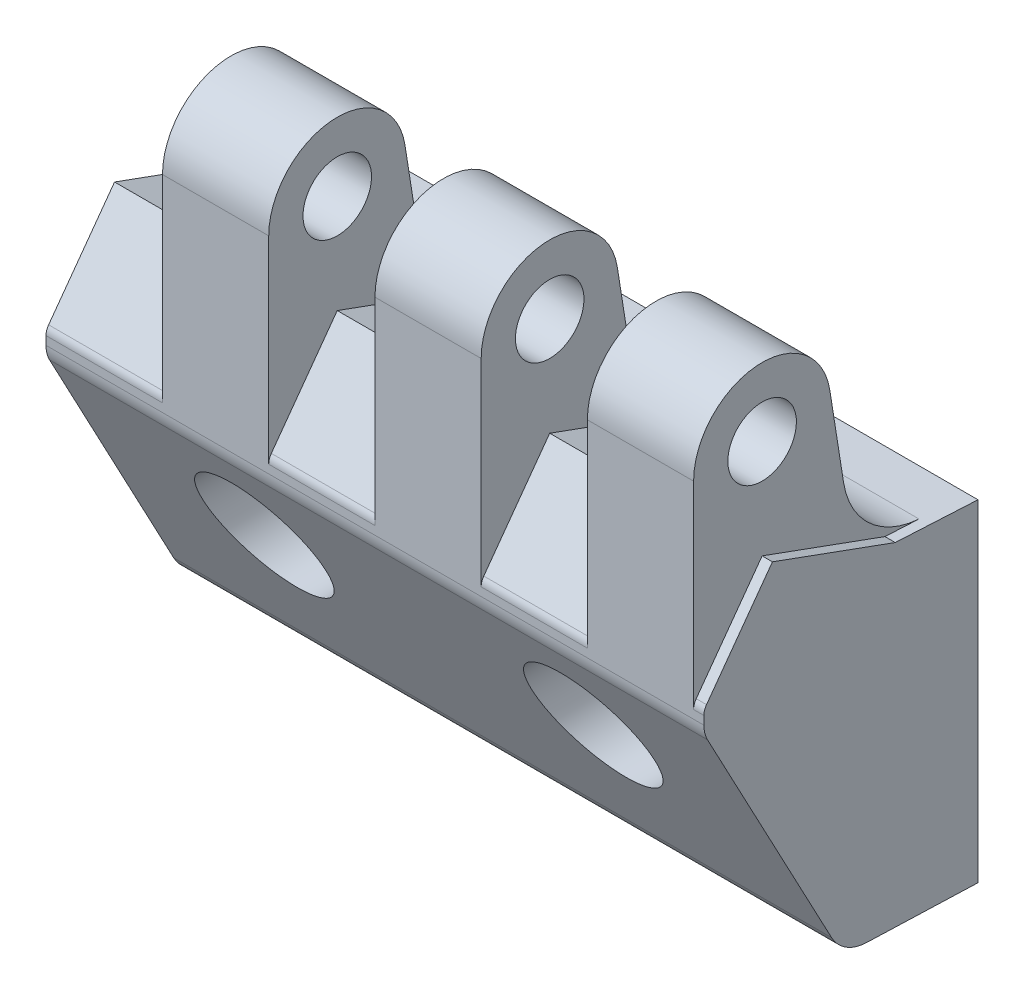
ISO-10303-21;
HEADER;
FILE_DESCRIPTION(('STEP AP214'),'2;1');
FILE_NAME('part.step','',(''),(''),'','','');
FILE_SCHEMA(('AUTOMOTIVE_DESIGN { 1 0 10303 214 1 1 1 1 }'));
ENDSEC;
DATA;
#1=APPLICATION_CONTEXT('core data for automotive mechanical design processes');
#2=APPLICATION_PROTOCOL_DEFINITION('international standard','automotive_design',2000,#1);
#3=PRODUCT_CONTEXT('',#1,'mechanical');
#4=PRODUCT('Part','Part','',(#3));
#5=PRODUCT_RELATED_PRODUCT_CATEGORY('part','',(#4));
#6=PRODUCT_DEFINITION_FORMATION('','',#4);
#7=PRODUCT_DEFINITION_CONTEXT('part definition',#1,'design');
#8=PRODUCT_DEFINITION('design','',#6,#7);
#9=PRODUCT_DEFINITION_SHAPE('','',#8);
#10=(LENGTH_UNIT() NAMED_UNIT(*) SI_UNIT(.MILLI.,.METRE.));
#11=(NAMED_UNIT(*) PLANE_ANGLE_UNIT() SI_UNIT($,.RADIAN.));
#12=(NAMED_UNIT(*) SI_UNIT($,.STERADIAN.) SOLID_ANGLE_UNIT());
#13=UNCERTAINTY_MEASURE_WITH_UNIT(LENGTH_MEASURE(1.E-05),#10,'distance_accuracy_value','');
#14=(GEOMETRIC_REPRESENTATION_CONTEXT(3) GLOBAL_UNCERTAINTY_ASSIGNED_CONTEXT((#13)) GLOBAL_UNIT_ASSIGNED_CONTEXT((#10,
#11,#12)) REPRESENTATION_CONTEXT('',''));
#15=CARTESIAN_POINT('',(0.,0.,0.));
#16=DIRECTION('',(0.,0.,1.));
#17=DIRECTION('',(1.,0.,0.));
#18=AXIS2_PLACEMENT_3D('',#15,#16,#17);
#19=CARTESIAN_POINT('',(-12.25,12.2,0.));
#20=DIRECTION('',(0.,0.99862953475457,-0.0523359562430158));
#21=DIRECTION('',(0.,0.0523359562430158,0.99862953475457));
#22=AXIS2_PLACEMENT_3D('',#19,#20,#21);
#23=PLANE('',#22);
#24=DIRECTION('',(1.,0.,0.));
#25=VECTOR('',#24,1.);
#26=CARTESIAN_POINT('',(-12.25,12.2,0.));
#27=LINE('',#26,#25);
#28=CARTESIAN_POINT('',(-12.,12.2,0.));
#29=VERTEX_POINT('',#28);
#30=CARTESIAN_POINT('',(36.,12.2,0.));
#31=VERTEX_POINT('',#30);
#32=EDGE_CURVE('E259',#29,#31,#27,.T.);
#33=ORIENTED_EDGE('',*,*,#32,.F.);
#34=DIRECTION('',(0.,-0.0523359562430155,-0.99862953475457));
#35=VECTOR('',#34,1.);
#36=CARTESIAN_POINT('',(-12.,12.516495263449,6.0390893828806));
#37=LINE('',#36,#35);
#38=CARTESIAN_POINT('',(-12.,12.516495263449,6.0390893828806));
#39=VERTEX_POINT('',#38);
#40=EDGE_CURVE('E241',#39,#29,#37,.T.);
#41=ORIENTED_EDGE('',*,*,#40,.F.);
#42=DIRECTION('',(1.,0.,0.));
#43=VECTOR('',#42,1.);
#44=CARTESIAN_POINT('',(-12.25,12.516495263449,6.0390893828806));
#45=LINE('',#44,#43);
#46=CARTESIAN_POINT('',(-3.5,12.516495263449,6.0390893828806));
#47=VERTEX_POINT('',#46);
#48=EDGE_CURVE('E263',#39,#47,#45,.T.);
#49=ORIENTED_EDGE('',*,*,#48,.T.);
#50=DIRECTION('',(0.,0.0523359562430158,0.99862953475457));
#51=VECTOR('',#50,1.);
#52=CARTESIAN_POINT('',(-3.5,12.2,0.));
#53=LINE('',#52,#51);
#54=CARTESIAN_POINT('',(-3.5,12.386207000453,3.55304122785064));
#55=VERTEX_POINT('',#54);
#56=EDGE_CURVE('E407',#55,#47,#53,.T.);
#57=ORIENTED_EDGE('',*,*,#56,.F.);
#58=DIRECTION('',(1.,0.,0.));
#59=VECTOR('',#58,1.);
#60=CARTESIAN_POINT('',(-3.5,12.386207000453,3.55304122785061));
#61=LINE('',#60,#59);
#62=CARTESIAN_POINT('',(4.25,12.386207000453,3.55304122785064));
#63=VERTEX_POINT('',#62);
#64=EDGE_CURVE('E261',#63,#55,#61,.F.);
#65=ORIENTED_EDGE('',*,*,#64,.F.);
#66=DIRECTION('',(0.,0.0523359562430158,0.99862953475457));
#67=VECTOR('',#66,1.);
#68=CARTESIAN_POINT('',(4.25,12.2,0.));
#69=LINE('',#68,#67);
#70=CARTESIAN_POINT('',(4.25,12.516495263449,6.0390893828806));
#71=VERTEX_POINT('',#70);
#72=EDGE_CURVE('E395',#63,#71,#69,.T.);
#73=ORIENTED_EDGE('',*,*,#72,.T.);
#74=CARTESIAN_POINT('',(12.,12.516495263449,6.0390893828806));
#75=VERTEX_POINT('',#74);
#76=EDGE_CURVE('E309',#71,#75,#45,.T.);
#77=ORIENTED_EDGE('',*,*,#76,.T.);
#78=DIRECTION('',(0.,0.0523359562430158,0.99862953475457));
#79=VECTOR('',#78,1.);
#80=CARTESIAN_POINT('',(12.,12.2,0.));
#81=LINE('',#80,#79);
#82=CARTESIAN_POINT('',(12.,12.386207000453,3.55304122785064));
#83=VERTEX_POINT('',#82);
#84=EDGE_CURVE('E456',#83,#75,#81,.T.);
#85=ORIENTED_EDGE('',*,*,#84,.F.);
#86=DIRECTION('',(-1.,0.,0.));
#87=VECTOR('',#86,1.);
#88=CARTESIAN_POINT('',(19.75,12.386207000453,3.55304122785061));
#89=LINE('',#88,#87);
#90=CARTESIAN_POINT('',(19.75,12.386207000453,3.55304122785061));
#91=VERTEX_POINT('',#90);
#92=EDGE_CURVE('E258',#83,#91,#89,.F.);
#93=ORIENTED_EDGE('',*,*,#92,.T.);
#94=DIRECTION('',(0.,0.0523359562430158,0.99862953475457));
#95=VECTOR('',#94,1.);
#96=CARTESIAN_POINT('',(19.75,12.2,0.));
#97=LINE('',#96,#95);
#98=CARTESIAN_POINT('',(19.75,12.516495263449,6.0390893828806));
#99=VERTEX_POINT('',#98);
#100=EDGE_CURVE('E322',#91,#99,#97,.T.);
#101=ORIENTED_EDGE('',*,*,#100,.T.);
#102=CARTESIAN_POINT('',(27.5,12.516495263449,6.0390893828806));
#103=VERTEX_POINT('',#102);
#104=EDGE_CURVE('E310',#99,#103,#45,.T.);
#105=ORIENTED_EDGE('',*,*,#104,.T.);
#106=DIRECTION('',(0.,0.0523359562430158,0.99862953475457));
#107=VECTOR('',#106,1.);
#108=CARTESIAN_POINT('',(27.5,12.2,0.));
#109=LINE('',#108,#107);
#110=CARTESIAN_POINT('',(27.5,12.386207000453,3.55304122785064));
#111=VERTEX_POINT('',#110);
#112=EDGE_CURVE('E319',#111,#103,#109,.T.);
#113=ORIENTED_EDGE('',*,*,#112,.F.);
#114=DIRECTION('',(-1.,0.,0.));
#115=VECTOR('',#114,1.);
#116=CARTESIAN_POINT('',(35.25,12.386207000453,3.55304122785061));
#117=LINE('',#116,#115);
#118=CARTESIAN_POINT('',(35.25,12.386207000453,3.55304122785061));
#119=VERTEX_POINT('',#118);
#120=EDGE_CURVE('E268',#111,#119,#117,.F.);
#121=ORIENTED_EDGE('',*,*,#120,.T.);
#122=DIRECTION('',(0.,0.0523359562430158,0.99862953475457));
#123=VECTOR('',#122,1.);
#124=CARTESIAN_POINT('',(35.25,12.2,0.));
#125=LINE('',#124,#123);
#126=CARTESIAN_POINT('',(35.25,12.516495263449,6.0390893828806));
#127=VERTEX_POINT('',#126);
#128=EDGE_CURVE('E345',#119,#127,#125,.T.);
#129=ORIENTED_EDGE('',*,*,#128,.T.);
#130=CARTESIAN_POINT('',(36.,12.516495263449,6.0390893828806));
#131=VERTEX_POINT('',#130);
#132=EDGE_CURVE('E306',#127,#131,#45,.T.);
#133=ORIENTED_EDGE('',*,*,#132,.T.);
#134=DIRECTION('',(0.,0.0523359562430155,0.99862953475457));
#135=VECTOR('',#134,1.);
#136=CARTESIAN_POINT('',(36.,12.2,0.));
#137=LINE('',#136,#135);
#138=EDGE_CURVE('E474',#31,#131,#137,.T.);
#139=ORIENTED_EDGE('',*,*,#138,.F.);
#140=EDGE_LOOP('',(#33,#41,#49,#57,#65,#73,#77,#85,#93,#101,#105,#113,#121,#129,#133,#139));
#141=FACE_BOUND('',#140,.T.);
#142=ADVANCED_FACE('F14',(#141),#23,.T.);
#143=CARTESIAN_POINT('',(-12.25,-11.715773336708,8.1391867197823));
#144=DIRECTION('',(0.,-0.999390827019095,0.0348994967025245));
#145=DIRECTION('',(0.,-0.0348994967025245,-0.999390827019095));
#146=AXIS2_PLACEMENT_3D('',#143,#144,#145);
#147=PLANE('',#146);
#148=DIRECTION('',(1.,0.,0.));
#149=VECTOR('',#148,1.);
#150=CARTESIAN_POINT('',(-12.25,-11.715773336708,8.1391867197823));
#151=LINE('',#150,#149);
#152=CARTESIAN_POINT('',(-12.,-11.715773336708,8.1391867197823));
#153=VERTEX_POINT('',#152);
#154=CARTESIAN_POINT('',(36.,-11.715773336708,8.1391867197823));
#155=VERTEX_POINT('',#154);
#156=EDGE_CURVE('E251',#153,#155,#151,.T.);
#157=ORIENTED_EDGE('',*,*,#156,.F.);
#158=DIRECTION('',(0.,0.034899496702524,0.999390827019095));
#159=VECTOR('',#158,1.);
#160=CARTESIAN_POINT('',(-12.,-12.,0.));
#161=LINE('',#160,#159);
#162=CARTESIAN_POINT('',(-12.,-12.,0.));
#163=VERTEX_POINT('',#162);
#164=EDGE_CURVE('E238',#163,#153,#161,.T.);
#165=ORIENTED_EDGE('',*,*,#164,.F.);
#166=DIRECTION('',(1.,0.,0.));
#167=VECTOR('',#166,1.);
#168=CARTESIAN_POINT('',(-12.25,-12.,0.));
#169=LINE('',#168,#167);
#170=CARTESIAN_POINT('',(36.,-12.,0.));
#171=VERTEX_POINT('',#170);
#172=EDGE_CURVE('E249',#163,#171,#169,.T.);
#173=ORIENTED_EDGE('',*,*,#172,.T.);
#174=DIRECTION('',(0.,-0.034899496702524,-0.999390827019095));
#175=VECTOR('',#174,1.);
#176=CARTESIAN_POINT('',(36.,-11.715773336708,8.1391867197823));
#177=LINE('',#176,#175);
#178=EDGE_CURVE('E471',#155,#171,#177,.T.);
#179=ORIENTED_EDGE('',*,*,#178,.F.);
#180=EDGE_LOOP('',(#157,#165,#173,#179));
#181=FACE_BOUND('',#180,.T.);
#182=ADVANCED_FACE('F16',(#181),#147,.T.);
#183=CARTESIAN_POINT('',(-12.25,-12.,0.));
#184=DIRECTION('',(0.,0.,-1.));
#185=DIRECTION('',(-1.,0.,0.));
#186=AXIS2_PLACEMENT_3D('',#183,#184,#185);
#187=PLANE('',#186);
#188=CARTESIAN_POINT('',(0.,0.,0.));
#189=DIRECTION('',(0.,0.,1.));
#190=DIRECTION('',(0.,-1.,0.));
#191=AXIS2_PLACEMENT_3D('',#188,#189,#190);
#192=CIRCLE('',#191,2.75);
#193=CARTESIAN_POINT('',(0.,-2.75,0.));
#194=VERTEX_POINT('',#193);
#195=EDGE_CURVE('E491',#194,#194,#192,.T.);
#196=ORIENTED_EDGE('',*,*,#195,.T.);
#197=EDGE_LOOP('',(#196));
#198=FACE_BOUND('',#197,.T.);
#199=CARTESIAN_POINT('',(24.,0.,0.));
#200=DIRECTION('',(0.,0.,1.));
#201=DIRECTION('',(0.,-1.,0.));
#202=AXIS2_PLACEMENT_3D('',#199,#200,#201);
#203=CIRCLE('',#202,2.75);
#204=CARTESIAN_POINT('',(24.,-2.75,0.));
#205=VERTEX_POINT('',#204);
#206=EDGE_CURVE('E500',#205,#205,#203,.T.);
#207=ORIENTED_EDGE('',*,*,#206,.T.);
#208=EDGE_LOOP('',(#207));
#209=FACE_BOUND('',#208,.T.);
#210=ORIENTED_EDGE('',*,*,#172,.F.);
#211=DIRECTION('',(0.,-1.,0.));
#212=VECTOR('',#211,1.);
#213=CARTESIAN_POINT('',(-12.,12.2,0.));
#214=LINE('',#213,#212);
#215=EDGE_CURVE('E235',#29,#163,#214,.T.);
#216=ORIENTED_EDGE('',*,*,#215,.F.);
#217=ORIENTED_EDGE('',*,*,#32,.T.);
#218=DIRECTION('',(0.,1.,0.));
#219=VECTOR('',#218,1.);
#220=CARTESIAN_POINT('',(36.,-12.,0.));
#221=LINE('',#220,#219);
#222=EDGE_CURVE('E257',#171,#31,#221,.T.);
#223=ORIENTED_EDGE('',*,*,#222,.F.);
#224=EDGE_LOOP('',(#210,#216,#217,#223));
#225=FACE_BOUND('',#224,.T.);
#226=ADVANCED_FACE('F255',(#198,#209,#225),#187,.T.);
#227=CARTESIAN_POINT('',(-12.25,8.571170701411,20.));
#228=DIRECTION('',(0.,0.,1.));
#229=DIRECTION('',(1.,0.,0.));
#230=AXIS2_PLACEMENT_3D('',#227,#228,#229);
#231=PLANE('',#230);
#232=DIRECTION('',(1.,0.,0.));
#233=VECTOR('',#232,1.);
#234=CARTESIAN_POINT('',(-12.25,8.571170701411,20.));
#235=LINE('',#234,#233);
#236=CARTESIAN_POINT('',(-12.,8.571170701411,20.));
#237=VERTEX_POINT('',#236);
#238=CARTESIAN_POINT('',(-3.5,8.571170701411,20.));
#239=VERTEX_POINT('',#238);
#240=EDGE_CURVE('E295',#237,#239,#235,.T.);
#241=ORIENTED_EDGE('',*,*,#240,.F.);
#242=DIRECTION('',(0.,1.,0.));
#243=VECTOR('',#242,1.);
#244=CARTESIAN_POINT('',(-12.,7.95707840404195,20.));
#245=LINE('',#244,#243);
#246=CARTESIAN_POINT('',(-12.,7.95707840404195,20.));
#247=VERTEX_POINT('',#246);
#248=EDGE_CURVE('E29',#247,#237,#245,.T.);
#249=ORIENTED_EDGE('',*,*,#248,.F.);
#250=DIRECTION('',(1.,0.,0.));
#251=VECTOR('',#250,1.);
#252=CARTESIAN_POINT('',(-12.25,7.957078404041,20.));
#253=LINE('',#252,#251);
#254=CARTESIAN_POINT('',(36.,7.957078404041,20.));
#255=VERTEX_POINT('',#254);
#256=EDGE_CURVE('E288',#247,#255,#253,.T.);
#257=ORIENTED_EDGE('',*,*,#256,.T.);
#258=DIRECTION('',(0.,-1.,0.));
#259=VECTOR('',#258,1.);
#260=CARTESIAN_POINT('',(36.,8.571170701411,20.));
#261=LINE('',#260,#259);
#262=CARTESIAN_POINT('',(36.,8.571170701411,20.));
#263=VERTEX_POINT('',#262);
#264=EDGE_CURVE('E485',#263,#255,#261,.T.);
#265=ORIENTED_EDGE('',*,*,#264,.F.);
#266=CARTESIAN_POINT('',(35.25,8.571170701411,20.));
#267=VERTEX_POINT('',#266);
#268=EDGE_CURVE('E290',#267,#263,#235,.T.);
#269=ORIENTED_EDGE('',*,*,#268,.F.);
#270=DIRECTION('',(0.,-1.,0.));
#271=VECTOR('',#270,1.);
#272=CARTESIAN_POINT('',(35.25,23.,20.));
#273=LINE('',#272,#271);
#274=CARTESIAN_POINT('',(35.25,23.,20.));
#275=VERTEX_POINT('',#274);
#276=EDGE_CURVE('E525',#275,#267,#273,.T.);
#277=ORIENTED_EDGE('',*,*,#276,.F.);
#278=DIRECTION('',(-1.,0.,0.));
#279=VECTOR('',#278,1.);
#280=CARTESIAN_POINT('',(35.25,23.,20.));
#281=LINE('',#280,#279);
#282=CARTESIAN_POINT('',(27.5,23.,20.));
#283=VERTEX_POINT('',#282);
#284=EDGE_CURVE('E537',#275,#283,#281,.T.);
#285=ORIENTED_EDGE('',*,*,#284,.T.);
#286=DIRECTION('',(0.,-1.,0.));
#287=VECTOR('',#286,1.);
#288=CARTESIAN_POINT('',(27.5,23.,20.));
#289=LINE('',#288,#287);
#290=CARTESIAN_POINT('',(27.5,8.571170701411,20.));
#291=VERTEX_POINT('',#290);
#292=EDGE_CURVE('E509',#283,#291,#289,.T.);
#293=ORIENTED_EDGE('',*,*,#292,.T.);
#294=CARTESIAN_POINT('',(19.75,8.571170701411,20.));
#295=VERTEX_POINT('',#294);
#296=EDGE_CURVE('E299',#295,#291,#235,.T.);
#297=ORIENTED_EDGE('',*,*,#296,.F.);
#298=DIRECTION('',(0.,-1.,0.));
#299=VECTOR('',#298,1.);
#300=CARTESIAN_POINT('',(19.75,23.,20.));
#301=LINE('',#300,#299);
#302=CARTESIAN_POINT('',(19.75,23.,20.));
#303=VERTEX_POINT('',#302);
#304=EDGE_CURVE('E426',#303,#295,#301,.T.);
#305=ORIENTED_EDGE('',*,*,#304,.F.);
#306=DIRECTION('',(-1.,0.,0.));
#307=VECTOR('',#306,1.);
#308=CARTESIAN_POINT('',(19.75,23.,20.));
#309=LINE('',#308,#307);
#310=CARTESIAN_POINT('',(12.,23.,20.));
#311=VERTEX_POINT('',#310);
#312=EDGE_CURVE('E438',#303,#311,#309,.T.);
#313=ORIENTED_EDGE('',*,*,#312,.T.);
#314=DIRECTION('',(0.,-1.,0.));
#315=VECTOR('',#314,1.);
#316=CARTESIAN_POINT('',(12.,23.,20.));
#317=LINE('',#316,#315);
#318=CARTESIAN_POINT('',(12.,8.571170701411,20.));
#319=VERTEX_POINT('',#318);
#320=EDGE_CURVE('E409',#311,#319,#317,.T.);
#321=ORIENTED_EDGE('',*,*,#320,.T.);
#322=CARTESIAN_POINT('',(4.25,8.571170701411,20.));
#323=VERTEX_POINT('',#322);
#324=EDGE_CURVE('E298',#323,#319,#235,.T.);
#325=ORIENTED_EDGE('',*,*,#324,.F.);
#326=DIRECTION('',(0.,-1.,0.));
#327=VECTOR('',#326,1.);
#328=CARTESIAN_POINT('',(4.25,23.,20.));
#329=LINE('',#328,#327);
#330=CARTESIAN_POINT('',(4.25,23.,20.));
#331=VERTEX_POINT('',#330);
#332=EDGE_CURVE('E347',#331,#323,#329,.T.);
#333=ORIENTED_EDGE('',*,*,#332,.F.);
#334=DIRECTION('',(1.,0.,0.));
#335=VECTOR('',#334,1.);
#336=CARTESIAN_POINT('',(-3.5,23.,20.));
#337=LINE('',#336,#335);
#338=CARTESIAN_POINT('',(-3.5,23.,20.));
#339=VERTEX_POINT('',#338);
#340=EDGE_CURVE('E379',#339,#331,#337,.T.);
#341=ORIENTED_EDGE('',*,*,#340,.F.);
#342=DIRECTION('',(0.,-1.,0.));
#343=VECTOR('',#342,1.);
#344=CARTESIAN_POINT('',(-3.5,23.,20.));
#345=LINE('',#344,#343);
#346=EDGE_CURVE('E365',#339,#239,#345,.T.);
#347=ORIENTED_EDGE('',*,*,#346,.T.);
#348=EDGE_LOOP('',(#241,#249,#257,#265,#269,#277,#285,#293,#297,#305,#313,#321,#325,#333,#341,#347));
#349=FACE_BOUND('',#348,.T.);
#350=ADVANCED_FACE('F584',(#349),#231,.T.);
#351=CARTESIAN_POINT('',(-12.25,7.95707840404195,17.7499999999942));
#352=DIRECTION('',(1.,0.,0.));
#353=DIRECTION('',(0.,1.,0.));
#354=AXIS2_PLACEMENT_3D('',#351,#352,#353);
#355=CYLINDRICAL_SURFACE('',#354,2.25000000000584);
#356=ORIENTED_EDGE('',*,*,#256,.F.);
#357=CARTESIAN_POINT('',(-12.,7.95707840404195,17.7499999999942));
#358=DIRECTION('',(-1.,0.,0.));
#359=DIRECTION('',(0.,0.,1.));
#360=AXIS2_PLACEMENT_3D('',#357,#358,#359);
#361=CIRCLE('',#360,2.25000000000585);
#362=CARTESIAN_POINT('',(-12.,6.900767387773,19.736632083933));
#363=VERTEX_POINT('',#362);
#364=EDGE_CURVE('E655',#363,#247,#361,.T.);
#365=ORIENTED_EDGE('',*,*,#364,.F.);
#366=DIRECTION('',(1.,0.,0.));
#367=VECTOR('',#366,1.);
#368=CARTESIAN_POINT('',(-12.25,6.900767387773,19.736632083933));
#369=LINE('',#368,#367);
#370=CARTESIAN_POINT('',(36.,6.900767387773,19.736632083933));
#371=VERTEX_POINT('',#370);
#372=EDGE_CURVE('E281',#363,#371,#369,.T.);
#373=ORIENTED_EDGE('',*,*,#372,.T.);
#374=CARTESIAN_POINT('',(36.,7.95707840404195,17.7499999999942));
#375=DIRECTION('',(1.,0.,0.));
#376=DIRECTION('',(0.,0.,-1.));
#377=AXIS2_PLACEMENT_3D('',#374,#375,#376);
#378=CIRCLE('',#377,2.25000000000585);
#379=EDGE_CURVE('E488',#255,#371,#378,.T.);
#380=ORIENTED_EDGE('',*,*,#379,.F.);
#381=EDGE_LOOP('',(#356,#365,#373,#380));
#382=FACE_BOUND('',#381,.T.);
#383=ADVANCED_FACE('F277',(#382),#355,.T.);
#384=CARTESIAN_POINT('',(-12.25,6.900767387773,19.736632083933));
#385=DIRECTION('',(0.,-0.469471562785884,0.882947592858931));
#386=DIRECTION('',(0.,-0.882947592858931,-0.469471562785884));
#387=AXIS2_PLACEMENT_3D('',#384,#385,#386);
#388=PLANE('',#387);
#389=CARTESIAN_POINT('',(0.,0.,16.0674289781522));
#390=DIRECTION('',(0.,-0.469471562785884,0.882947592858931));
#391=DIRECTION('',(0.,0.882947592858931,0.469471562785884));
#392=AXIS2_PLACEMENT_3D('',#389,#390,#391);
#393=ELLIPSE('',#392,5.09656522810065,4.5);
#394=CARTESIAN_POINT('',(0.,4.5,18.4601214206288));
#395=VERTEX_POINT('',#394);
#396=EDGE_CURVE('E9',#395,#395,#393,.T.);
#397=ORIENTED_EDGE('',*,*,#396,.F.);
#398=EDGE_LOOP('',(#397));
#399=FACE_BOUND('',#398,.T.);
#400=CARTESIAN_POINT('',(24.,0.,16.0674289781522));
#401=DIRECTION('',(0.,-0.469471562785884,0.882947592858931));
#402=DIRECTION('',(0.,0.882947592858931,0.469471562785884));
#403=AXIS2_PLACEMENT_3D('',#400,#401,#402);
#404=ELLIPSE('',#403,5.09656522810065,4.5);
#405=CARTESIAN_POINT('',(24.,4.5,18.4601214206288));
#406=VERTEX_POINT('',#405);
#407=EDGE_CURVE('E22',#406,#406,#404,.T.);
#408=ORIENTED_EDGE('',*,*,#407,.F.);
#409=EDGE_LOOP('',(#408));
#410=FACE_BOUND('',#409,.T.);
#411=ORIENTED_EDGE('',*,*,#372,.F.);
#412=DIRECTION('',(0.,0.882947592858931,0.469471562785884));
#413=VECTOR('',#412,1.);
#414=CARTESIAN_POINT('',(-12.,-10.126015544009,10.683331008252));
#415=LINE('',#414,#413);
#416=CARTESIAN_POINT('',(-12.,-10.126015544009,10.683331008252));
#417=VERTEX_POINT('',#416);
#418=EDGE_CURVE('E282',#417,#363,#415,.T.);
#419=ORIENTED_EDGE('',*,*,#418,.F.);
#420=DIRECTION('',(1.,0.,0.));
#421=VECTOR('',#420,1.);
#422=CARTESIAN_POINT('',(-12.25,-10.126015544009,10.683331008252));
#423=LINE('',#422,#421);
#424=CARTESIAN_POINT('',(36.,-10.126015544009,10.683331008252));
#425=VERTEX_POINT('',#424);
#426=EDGE_CURVE('E37',#417,#425,#423,.T.);
#427=ORIENTED_EDGE('',*,*,#426,.T.);
#428=DIRECTION('',(0.,-0.882947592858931,-0.469471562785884));
#429=VECTOR('',#428,1.);
#430=CARTESIAN_POINT('',(36.,6.900767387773,19.736632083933));
#431=LINE('',#430,#429);
#432=EDGE_CURVE('E283',#371,#425,#431,.T.);
#433=ORIENTED_EDGE('',*,*,#432,.F.);
#434=EDGE_LOOP('',(#411,#419,#427,#433));
#435=FACE_BOUND('',#434,.T.);
#436=ADVANCED_FACE('F274',(#399,#410,#435),#388,.T.);
#437=CARTESIAN_POINT('',(-12.25,-8.7176008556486,8.03448822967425));
#438=DIRECTION('',(1.,0.,0.));
#439=DIRECTION('',(0.,1.,0.));
#440=AXIS2_PLACEMENT_3D('',#437,#438,#439);
#441=CYLINDRICAL_SURFACE('',#440,3.00000000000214);
#442=ORIENTED_EDGE('',*,*,#426,.F.);
#443=CARTESIAN_POINT('',(-12.,-8.7176008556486,8.03448822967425));
#444=DIRECTION('',(-1.,0.,0.));
#445=DIRECTION('',(0.,0.,1.));
#446=AXIS2_PLACEMENT_3D('',#443,#444,#445);
#447=CIRCLE('',#446,3.00000000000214);
#448=EDGE_CURVE('E252',#153,#417,#447,.T.);
#449=ORIENTED_EDGE('',*,*,#448,.F.);
#450=ORIENTED_EDGE('',*,*,#156,.T.);
#451=CARTESIAN_POINT('',(36.,-8.7176008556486,8.03448822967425));
#452=DIRECTION('',(1.,0.,0.));
#453=DIRECTION('',(0.,0.,-1.));
#454=AXIS2_PLACEMENT_3D('',#451,#452,#453);
#455=CIRCLE('',#454,3.00000000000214);
#456=EDGE_CURVE('E468',#425,#155,#455,.T.);
#457=ORIENTED_EDGE('',*,*,#456,.F.);
#458=EDGE_LOOP('',(#442,#449,#450,#457));
#459=FACE_BOUND('',#458,.T.);
#460=ADVANCED_FACE('F276',(#459),#441,.T.);
#461=CARTESIAN_POINT('',(-12.25,12.516495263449,6.0390893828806));
#462=DIRECTION('',(0.,0.939692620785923,-0.342020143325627));
#463=DIRECTION('',(0.,0.342020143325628,0.939692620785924));
#464=AXIS2_PLACEMENT_3D('',#461,#462,#463);
#465=PLANE('',#464);
#466=ORIENTED_EDGE('',*,*,#48,.F.);
#467=DIRECTION('',(0.,-0.342020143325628,-0.939692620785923));
#468=VECTOR('',#467,1.);
#469=CARTESIAN_POINT('',(-12.,15.778,15.));
#470=LINE('',#469,#468);
#471=CARTESIAN_POINT('',(-12.,15.778,15.));
#472=VERTEX_POINT('',#471);
#473=EDGE_CURVE('E1478',#472,#39,#470,.T.);
#474=ORIENTED_EDGE('',*,*,#473,.F.);
#475=DIRECTION('',(1.,0.,0.));
#476=VECTOR('',#475,1.);
#477=CARTESIAN_POINT('',(-12.25,15.778,15.));
#478=LINE('',#477,#476);
#479=CARTESIAN_POINT('',(-3.5,15.778,15.));
#480=VERTEX_POINT('',#479);
#481=EDGE_CURVE('E305',#472,#480,#478,.T.);
#482=ORIENTED_EDGE('',*,*,#481,.T.);
#483=DIRECTION('',(0.,0.342020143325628,0.939692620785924));
#484=VECTOR('',#483,1.);
#485=CARTESIAN_POINT('',(-3.5,12.516495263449,6.0390893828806));
#486=LINE('',#485,#484);
#487=EDGE_CURVE('E404',#47,#480,#486,.T.);
#488=ORIENTED_EDGE('',*,*,#487,.F.);
#489=EDGE_LOOP('',(#466,#474,#482,#488));
#490=FACE_BOUND('',#489,.T.);
#491=ADVANCED_FACE('F690',(#490),#465,.T.);
#492=CARTESIAN_POINT('',(-12.25,15.778,15.));
#493=DIRECTION('',(0.,0.587785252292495,0.809016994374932));
#494=DIRECTION('',(0.,-0.809016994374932,0.587785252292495));
#495=AXIS2_PLACEMENT_3D('',#492,#493,#494);
#496=PLANE('',#495);
#497=ORIENTED_EDGE('',*,*,#481,.F.);
#498=DIRECTION('',(0.,0.809016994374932,-0.587785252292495));
#499=VECTOR('',#498,1.);
#500=CARTESIAN_POINT('',(-12.,9.158955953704,19.809016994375));
#501=LINE('',#500,#499);
#502=CARTESIAN_POINT('',(-12.,9.158955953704,19.809016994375));
#503=VERTEX_POINT('',#502);
#504=EDGE_CURVE('E1475',#503,#472,#501,.T.);
#505=ORIENTED_EDGE('',*,*,#504,.F.);
#506=DIRECTION('',(1.,0.,0.));
#507=VECTOR('',#506,1.);
#508=CARTESIAN_POINT('',(-12.25,9.158955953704,19.809016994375));
#509=LINE('',#508,#507);
#510=CARTESIAN_POINT('',(-3.5,9.158955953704,19.809016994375));
#511=VERTEX_POINT('',#510);
#512=EDGE_CURVE('E300',#503,#511,#509,.T.);
#513=ORIENTED_EDGE('',*,*,#512,.T.);
#514=DIRECTION('',(0.,-0.809016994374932,0.587785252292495));
#515=VECTOR('',#514,1.);
#516=CARTESIAN_POINT('',(-3.5,15.778,15.));
#517=LINE('',#516,#515);
#518=EDGE_CURVE('E401',#480,#511,#517,.T.);
#519=ORIENTED_EDGE('',*,*,#518,.F.);
#520=EDGE_LOOP('',(#497,#505,#513,#519));
#521=FACE_BOUND('',#520,.T.);
#522=ADVANCED_FACE('F847',(#521),#496,.T.);
#523=CARTESIAN_POINT('',(-12.25,8.5711707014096,18.9999999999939));
#524=DIRECTION('',(1.,0.,0.));
#525=DIRECTION('',(0.,1.,0.));
#526=AXIS2_PLACEMENT_3D('',#523,#524,#525);
#527=CYLINDRICAL_SURFACE('',#526,1.00000000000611);
#528=ORIENTED_EDGE('',*,*,#512,.F.);
#529=CARTESIAN_POINT('',(-12.,8.5711707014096,18.9999999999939));
#530=DIRECTION('',(-1.,0.,0.));
#531=DIRECTION('',(0.,0.,1.));
#532=AXIS2_PLACEMENT_3D('',#529,#530,#531);
#533=CIRCLE('',#532,1.0000000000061);
#534=EDGE_CURVE('E653',#237,#503,#533,.T.);
#535=ORIENTED_EDGE('',*,*,#534,.F.);
#536=ORIENTED_EDGE('',*,*,#240,.T.);
#537=CARTESIAN_POINT('',(-3.5,8.5711707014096,18.9999999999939));
#538=DIRECTION('',(-1.,0.,0.));
#539=DIRECTION('',(0.,-1.,0.));
#540=AXIS2_PLACEMENT_3D('',#537,#538,#539);
#541=CIRCLE('',#540,1.00000000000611);
#542=EDGE_CURVE('E398',#511,#239,#541,.F.);
#543=ORIENTED_EDGE('',*,*,#542,.F.);
#544=EDGE_LOOP('',(#528,#535,#536,#543));
#545=FACE_BOUND('',#544,.T.);
#546=ADVANCED_FACE('F652',(#545),#527,.T.);
#547=CARTESIAN_POINT('',(35.25,15.778,15.));
#548=VERTEX_POINT('',#547);
#549=CARTESIAN_POINT('',(36.,15.778,15.));
#550=VERTEX_POINT('',#549);
#551=EDGE_CURVE('E302',#548,#550,#478,.T.);
#552=ORIENTED_EDGE('',*,*,#551,.T.);
#553=DIRECTION('',(0.,0.342020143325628,0.939692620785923));
#554=VECTOR('',#553,1.);
#555=CARTESIAN_POINT('',(36.,12.516495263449,6.0390893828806));
#556=LINE('',#555,#554);
#557=EDGE_CURVE('E479',#131,#550,#556,.T.);
#558=ORIENTED_EDGE('',*,*,#557,.F.);
#559=ORIENTED_EDGE('',*,*,#132,.F.);
#560=DIRECTION('',(0.,0.342020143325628,0.939692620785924));
#561=VECTOR('',#560,1.);
#562=CARTESIAN_POINT('',(35.25,12.516495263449,6.0390893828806));
#563=LINE('',#562,#561);
#564=EDGE_CURVE('E343',#127,#548,#563,.T.);
#565=ORIENTED_EDGE('',*,*,#564,.T.);
#566=EDGE_LOOP('',(#552,#558,#559,#565));
#567=FACE_BOUND('',#566,.T.);
#568=ADVANCED_FACE('F561',(#567),#465,.T.);
#569=CARTESIAN_POINT('',(35.25,9.158955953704,19.809016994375));
#570=VERTEX_POINT('',#569);
#571=CARTESIAN_POINT('',(36.,9.158955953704,19.809016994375));
#572=VERTEX_POINT('',#571);
#573=EDGE_CURVE('E297',#570,#572,#509,.T.);
#574=ORIENTED_EDGE('',*,*,#573,.T.);
#575=DIRECTION('',(0.,-0.809016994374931,0.587785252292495));
#576=VECTOR('',#575,1.);
#577=CARTESIAN_POINT('',(36.,15.778,15.));
#578=LINE('',#577,#576);
#579=EDGE_CURVE('E481',#550,#572,#578,.T.);
#580=ORIENTED_EDGE('',*,*,#579,.F.);
#581=ORIENTED_EDGE('',*,*,#551,.F.);
#582=DIRECTION('',(0.,-0.809016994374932,0.587785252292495));
#583=VECTOR('',#582,1.);
#584=CARTESIAN_POINT('',(35.25,15.778,15.));
#585=LINE('',#584,#583);
#586=EDGE_CURVE('E336',#548,#570,#585,.T.);
#587=ORIENTED_EDGE('',*,*,#586,.T.);
#588=EDGE_LOOP('',(#574,#580,#581,#587));
#589=FACE_BOUND('',#588,.T.);
#590=ADVANCED_FACE('F568',(#589),#496,.T.);
#591=ORIENTED_EDGE('',*,*,#268,.T.);
#592=CARTESIAN_POINT('',(36.,8.5711707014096,18.9999999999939));
#593=DIRECTION('',(1.,0.,0.));
#594=DIRECTION('',(0.,0.,-1.));
#595=AXIS2_PLACEMENT_3D('',#592,#593,#594);
#596=CIRCLE('',#595,1.00000000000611);
#597=EDGE_CURVE('E483',#572,#263,#596,.T.);
#598=ORIENTED_EDGE('',*,*,#597,.F.);
#599=ORIENTED_EDGE('',*,*,#573,.F.);
#600=CARTESIAN_POINT('',(35.25,8.5711707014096,18.9999999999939));
#601=DIRECTION('',(-1.,0.,0.));
#602=DIRECTION('',(0.,-1.,0.));
#603=AXIS2_PLACEMENT_3D('',#600,#601,#602);
#604=CIRCLE('',#603,1.00000000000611);
#605=EDGE_CURVE('E334',#570,#267,#604,.F.);
#606=ORIENTED_EDGE('',*,*,#605,.T.);
#607=EDGE_LOOP('',(#591,#598,#599,#606));
#608=FACE_BOUND('',#607,.T.);
#609=ADVANCED_FACE('F579',(#608),#527,.T.);
#610=ORIENTED_EDGE('',*,*,#76,.F.);
#611=DIRECTION('',(0.,0.342020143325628,0.939692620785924));
#612=VECTOR('',#611,1.);
#613=CARTESIAN_POINT('',(4.25,12.516495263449,6.0390893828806));
#614=LINE('',#613,#612);
#615=CARTESIAN_POINT('',(4.25,15.778,15.));
#616=VERTEX_POINT('',#615);
#617=EDGE_CURVE('E392',#71,#616,#614,.T.);
#618=ORIENTED_EDGE('',*,*,#617,.T.);
#619=CARTESIAN_POINT('',(12.,15.778,15.));
#620=VERTEX_POINT('',#619);
#621=EDGE_CURVE('E307',#616,#620,#478,.T.);
#622=ORIENTED_EDGE('',*,*,#621,.T.);
#623=DIRECTION('',(0.,0.342020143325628,0.939692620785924));
#624=VECTOR('',#623,1.);
#625=CARTESIAN_POINT('',(12.,12.516495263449,6.0390893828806));
#626=LINE('',#625,#624);
#627=EDGE_CURVE('E453',#75,#620,#626,.T.);
#628=ORIENTED_EDGE('',*,*,#627,.F.);
#629=EDGE_LOOP('',(#610,#618,#622,#628));
#630=FACE_BOUND('',#629,.T.);
#631=ADVANCED_FACE('F628',(#630),#465,.T.);
#632=ORIENTED_EDGE('',*,*,#621,.F.);
#633=DIRECTION('',(0.,-0.809016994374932,0.587785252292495));
#634=VECTOR('',#633,1.);
#635=CARTESIAN_POINT('',(4.25,15.778,15.));
#636=LINE('',#635,#634);
#637=CARTESIAN_POINT('',(4.25,9.158955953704,19.809016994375));
#638=VERTEX_POINT('',#637);
#639=EDGE_CURVE('E389',#616,#638,#636,.T.);
#640=ORIENTED_EDGE('',*,*,#639,.T.);
#641=CARTESIAN_POINT('',(12.,9.158955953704,19.809016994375));
#642=VERTEX_POINT('',#641);
#643=EDGE_CURVE('E303',#638,#642,#509,.T.);
#644=ORIENTED_EDGE('',*,*,#643,.T.);
#645=DIRECTION('',(0.,-0.809016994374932,0.587785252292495));
#646=VECTOR('',#645,1.);
#647=CARTESIAN_POINT('',(12.,15.778,15.));
#648=LINE('',#647,#646);
#649=EDGE_CURVE('E450',#620,#642,#648,.T.);
#650=ORIENTED_EDGE('',*,*,#649,.F.);
#651=EDGE_LOOP('',(#632,#640,#644,#650));
#652=FACE_BOUND('',#651,.T.);
#653=ADVANCED_FACE('F622',(#652),#496,.T.);
#654=ORIENTED_EDGE('',*,*,#643,.F.);
#655=CARTESIAN_POINT('',(4.25,8.5711707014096,18.9999999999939));
#656=DIRECTION('',(-1.,0.,0.));
#657=DIRECTION('',(0.,-1.,0.));
#658=AXIS2_PLACEMENT_3D('',#655,#656,#657);
#659=CIRCLE('',#658,1.00000000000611);
#660=EDGE_CURVE('E386',#638,#323,#659,.F.);
#661=ORIENTED_EDGE('',*,*,#660,.T.);
#662=ORIENTED_EDGE('',*,*,#324,.T.);
#663=CARTESIAN_POINT('',(12.,8.5711707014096,18.9999999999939));
#664=DIRECTION('',(-1.,0.,0.));
#665=DIRECTION('',(0.,-1.,0.));
#666=AXIS2_PLACEMENT_3D('',#663,#664,#665);
#667=CIRCLE('',#666,1.00000000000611);
#668=EDGE_CURVE('E447',#642,#319,#667,.F.);
#669=ORIENTED_EDGE('',*,*,#668,.F.);
#670=EDGE_LOOP('',(#654,#661,#662,#669));
#671=FACE_BOUND('',#670,.T.);
#672=ADVANCED_FACE('F589',(#671),#527,.T.);
#673=DIRECTION('',(0.,0.342020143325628,0.939692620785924));
#674=VECTOR('',#673,1.);
#675=CARTESIAN_POINT('',(27.5,12.516495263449,6.0390893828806));
#676=LINE('',#675,#674);
#677=CARTESIAN_POINT('',(27.5,15.778,15.));
#678=VERTEX_POINT('',#677);
#679=EDGE_CURVE('E331',#103,#678,#676,.T.);
#680=ORIENTED_EDGE('',*,*,#679,.F.);
#681=ORIENTED_EDGE('',*,*,#104,.F.);
#682=DIRECTION('',(0.,0.342020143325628,0.939692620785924));
#683=VECTOR('',#682,1.);
#684=CARTESIAN_POINT('',(19.75,12.516495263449,6.0390893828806));
#685=LINE('',#684,#683);
#686=CARTESIAN_POINT('',(19.75,15.778,15.));
#687=VERTEX_POINT('',#686);
#688=EDGE_CURVE('E463',#99,#687,#685,.T.);
#689=ORIENTED_EDGE('',*,*,#688,.T.);
#690=EDGE_CURVE('E308',#687,#678,#478,.T.);
#691=ORIENTED_EDGE('',*,*,#690,.T.);
#692=EDGE_LOOP('',(#680,#681,#689,#691));
#693=FACE_BOUND('',#692,.T.);
#694=ADVANCED_FACE('F556',(#693),#465,.T.);
#695=DIRECTION('',(0.,-0.809016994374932,0.587785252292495));
#696=VECTOR('',#695,1.);
#697=CARTESIAN_POINT('',(27.5,15.778,15.));
#698=LINE('',#697,#696);
#699=CARTESIAN_POINT('',(27.5,9.158955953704,19.809016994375));
#700=VERTEX_POINT('',#699);
#701=EDGE_CURVE('E338',#678,#700,#698,.T.);
#702=ORIENTED_EDGE('',*,*,#701,.F.);
#703=ORIENTED_EDGE('',*,*,#690,.F.);
#704=DIRECTION('',(0.,-0.809016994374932,0.587785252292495));
#705=VECTOR('',#704,1.);
#706=CARTESIAN_POINT('',(19.75,15.778,15.));
#707=LINE('',#706,#705);
#708=CARTESIAN_POINT('',(19.75,9.158955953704,19.809016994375));
#709=VERTEX_POINT('',#708);
#710=EDGE_CURVE('E461',#687,#709,#707,.T.);
#711=ORIENTED_EDGE('',*,*,#710,.T.);
#712=EDGE_CURVE('E304',#709,#700,#509,.T.);
#713=ORIENTED_EDGE('',*,*,#712,.T.);
#714=EDGE_LOOP('',(#702,#703,#711,#713));
#715=FACE_BOUND('',#714,.T.);
#716=ADVANCED_FACE('F553',(#715),#496,.T.);
#717=CARTESIAN_POINT('',(27.5,8.5711707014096,18.9999999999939));
#718=DIRECTION('',(-1.,0.,0.));
#719=DIRECTION('',(0.,-1.,0.));
#720=AXIS2_PLACEMENT_3D('',#717,#718,#719);
#721=CIRCLE('',#720,1.00000000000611);
#722=EDGE_CURVE('E546',#700,#291,#721,.F.);
#723=ORIENTED_EDGE('',*,*,#722,.F.);
#724=ORIENTED_EDGE('',*,*,#712,.F.);
#725=CARTESIAN_POINT('',(19.75,8.5711707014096,18.9999999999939));
#726=DIRECTION('',(-1.,0.,0.));
#727=DIRECTION('',(0.,-1.,0.));
#728=AXIS2_PLACEMENT_3D('',#725,#726,#727);
#729=CIRCLE('',#728,1.00000000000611);
#730=EDGE_CURVE('E459',#709,#295,#729,.F.);
#731=ORIENTED_EDGE('',*,*,#730,.T.);
#732=ORIENTED_EDGE('',*,*,#296,.T.);
#733=EDGE_LOOP('',(#723,#724,#731,#732));
#734=FACE_BOUND('',#733,.T.);
#735=ADVANCED_FACE('F619',(#734),#527,.T.);
#736=CARTESIAN_POINT('',(19.75,18.3712579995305,3.12976290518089));
#737=DIRECTION('',(-1.,0.,0.));
#738=DIRECTION('',(0.,-1.,0.));
#739=AXIS2_PLACEMENT_3D('',#736,#737,#738);
#740=CYLINDRICAL_SURFACE('',#739,6.00000000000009);
#741=ORIENTED_EDGE('',*,*,#92,.F.);
#742=CARTESIAN_POINT('',(12.,18.3712579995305,3.12976290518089));
#743=DIRECTION('',(-1.,0.,0.));
#744=DIRECTION('',(0.,1.,0.));
#745=AXIS2_PLACEMENT_3D('',#742,#743,#744);
#746=CIRCLE('',#745,6.00000000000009);
#747=CARTESIAN_POINT('',(12.,17.4326512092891,9.0558929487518));
#748=VERTEX_POINT('',#747);
#749=EDGE_CURVE('E410',#83,#748,#746,.T.);
#750=ORIENTED_EDGE('',*,*,#749,.T.);
#751=DIRECTION('',(-1.,0.,0.));
#752=VECTOR('',#751,1.);
#753=CARTESIAN_POINT('',(19.75,17.4326512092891,9.0558929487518));
#754=LINE('',#753,#752);
#755=CARTESIAN_POINT('',(19.75,17.4326512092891,9.0558929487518));
#756=VERTEX_POINT('',#755);
#757=EDGE_CURVE('E444',#756,#748,#754,.T.);
#758=ORIENTED_EDGE('',*,*,#757,.F.);
#759=CARTESIAN_POINT('',(19.75,18.3712579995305,3.12976290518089));
#760=DIRECTION('',(-1.,0.,0.));
#761=DIRECTION('',(0.,1.,0.));
#762=AXIS2_PLACEMENT_3D('',#759,#760,#761);
#763=CIRCLE('',#762,6.00000000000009);
#764=EDGE_CURVE('E427',#91,#756,#763,.T.);
#765=ORIENTED_EDGE('',*,*,#764,.F.);
#766=EDGE_LOOP('',(#741,#750,#758,#765));
#767=FACE_BOUND('',#766,.T.);
#768=ADVANCED_FACE('F613',(#767),#740,.F.);
#769=CARTESIAN_POINT('',(19.75,17.4326512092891,9.0558929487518));
#770=DIRECTION('',(0.,-0.156434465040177,0.987688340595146));
#771=DIRECTION('',(0.,-0.987688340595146,-0.156434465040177));
#772=AXIS2_PLACEMENT_3D('',#769,#770,#771);
#773=PLANE('',#772);
#774=DIRECTION('',(0.,0.987688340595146,0.156434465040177));
#775=VECTOR('',#774,1.);
#776=CARTESIAN_POINT('',(12.,17.4326512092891,9.0558929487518));
#777=LINE('',#776,#775);
#778=CARTESIAN_POINT('',(12.,23.7821723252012,10.061558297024));
#779=VERTEX_POINT('',#778);
#780=EDGE_CURVE('E413',#748,#779,#777,.T.);
#781=ORIENTED_EDGE('',*,*,#780,.T.);
#782=DIRECTION('',(-1.,0.,0.));
#783=VECTOR('',#782,1.);
#784=CARTESIAN_POINT('',(19.75,23.7821723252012,10.061558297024));
#785=LINE('',#784,#783);
#786=CARTESIAN_POINT('',(19.75,23.7821723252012,10.061558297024));
#787=VERTEX_POINT('',#786);
#788=EDGE_CURVE('E441',#787,#779,#785,.T.);
#789=ORIENTED_EDGE('',*,*,#788,.F.);
#790=DIRECTION('',(0.,0.987688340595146,0.156434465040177));
#791=VECTOR('',#790,1.);
#792=CARTESIAN_POINT('',(19.75,17.4326512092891,9.0558929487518));
#793=LINE('',#792,#791);
#794=EDGE_CURVE('E429',#756,#787,#793,.T.);
#795=ORIENTED_EDGE('',*,*,#794,.F.);
#796=ORIENTED_EDGE('',*,*,#757,.T.);
#797=EDGE_LOOP('',(#781,#789,#795,#796));
#798=FACE_BOUND('',#797,.T.);
#799=ADVANCED_FACE('F607',(#798),#773,.F.);
#800=CARTESIAN_POINT('',(19.75,23.,14.9999999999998));
#801=DIRECTION('',(-1.,0.,0.));
#802=DIRECTION('',(0.,-1.,0.));
#803=AXIS2_PLACEMENT_3D('',#800,#801,#802);
#804=CYLINDRICAL_SURFACE('',#803,5.00000000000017);
#805=CARTESIAN_POINT('',(12.,23.,14.9999999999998));
#806=DIRECTION('',(1.,0.,0.));
#807=DIRECTION('',(0.,-1.,0.));
#808=AXIS2_PLACEMENT_3D('',#805,#806,#807);
#809=CIRCLE('',#808,5.00000000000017);
#810=EDGE_CURVE('E416',#779,#311,#809,.T.);
#811=ORIENTED_EDGE('',*,*,#810,.T.);
#812=ORIENTED_EDGE('',*,*,#312,.F.);
#813=CARTESIAN_POINT('',(19.75,23.,14.9999999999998));
#814=DIRECTION('',(1.,0.,0.));
#815=DIRECTION('',(0.,-1.,0.));
#816=AXIS2_PLACEMENT_3D('',#813,#814,#815);
#817=CIRCLE('',#816,5.00000000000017);
#818=EDGE_CURVE('E431',#787,#303,#817,.T.);
#819=ORIENTED_EDGE('',*,*,#818,.F.);
#820=ORIENTED_EDGE('',*,*,#788,.T.);
#821=EDGE_LOOP('',(#811,#812,#819,#820));
#822=FACE_BOUND('',#821,.T.);
#823=ADVANCED_FACE('F603',(#822),#804,.T.);
#824=CARTESIAN_POINT('',(19.75,23.,15.));
#825=DIRECTION('',(-1.,0.,0.));
#826=DIRECTION('',(0.,-1.,0.));
#827=AXIS2_PLACEMENT_3D('',#824,#825,#826);
#828=CYLINDRICAL_SURFACE('',#827,2.5);
#829=CARTESIAN_POINT('',(19.75,23.,15.));
#830=DIRECTION('',(1.,0.,0.));
#831=DIRECTION('',(0.,1.,0.));
#832=AXIS2_PLACEMENT_3D('',#829,#830,#831);
#833=CIRCLE('',#832,2.5);
#834=CARTESIAN_POINT('',(19.75,25.5,15.));
#835=VERTEX_POINT('',#834);
#836=EDGE_CURVE('E433',#835,#835,#833,.T.);
#837=ORIENTED_EDGE('',*,*,#836,.T.);
#838=EDGE_LOOP('',(#837));
#839=FACE_BOUND('',#838,.T.);
#840=CARTESIAN_POINT('',(12.,23.,15.));
#841=DIRECTION('',(1.,0.,0.));
#842=DIRECTION('',(0.,1.,0.));
#843=AXIS2_PLACEMENT_3D('',#840,#841,#842);
#844=CIRCLE('',#843,2.5);
#845=CARTESIAN_POINT('',(12.,25.5,15.));
#846=VERTEX_POINT('',#845);
#847=EDGE_CURVE('E419',#846,#846,#844,.T.);
#848=ORIENTED_EDGE('',*,*,#847,.F.);
#849=EDGE_LOOP('',(#848));
#850=FACE_BOUND('',#849,.T.);
#851=ADVANCED_FACE('F969',(#839,#850),#828,.F.);
#852=CARTESIAN_POINT('',(19.75,18.3712579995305,3.12976290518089));
#853=DIRECTION('',(-1.,0.,0.));
#854=DIRECTION('',(0.,-1.,0.));
#855=AXIS2_PLACEMENT_3D('',#852,#853,#854);
#856=PLANE('',#855);
#857=ORIENTED_EDGE('',*,*,#100,.F.);
#858=ORIENTED_EDGE('',*,*,#764,.T.);
#859=ORIENTED_EDGE('',*,*,#794,.T.);
#860=ORIENTED_EDGE('',*,*,#818,.T.);
#861=ORIENTED_EDGE('',*,*,#304,.T.);
#862=ORIENTED_EDGE('',*,*,#730,.F.);
#863=ORIENTED_EDGE('',*,*,#710,.F.);
#864=ORIENTED_EDGE('',*,*,#688,.F.);
#865=EDGE_LOOP('',(#857,#858,#859,#860,#861,#862,#863,#864));
#866=FACE_BOUND('',#865,.T.);
#867=ORIENTED_EDGE('',*,*,#836,.F.);
#868=EDGE_LOOP('',(#867));
#869=FACE_BOUND('',#868,.T.);
#870=ADVANCED_FACE('F615',(#866,#869),#856,.F.);
#871=CARTESIAN_POINT('',(12.,18.3712579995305,3.12976290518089));
#872=DIRECTION('',(-1.,0.,0.));
#873=DIRECTION('',(0.,-1.,0.));
#874=AXIS2_PLACEMENT_3D('',#871,#872,#873);
#875=PLANE('',#874);
#876=ORIENTED_EDGE('',*,*,#749,.F.);
#877=ORIENTED_EDGE('',*,*,#84,.T.);
#878=ORIENTED_EDGE('',*,*,#627,.T.);
#879=ORIENTED_EDGE('',*,*,#649,.T.);
#880=ORIENTED_EDGE('',*,*,#668,.T.);
#881=ORIENTED_EDGE('',*,*,#320,.F.);
#882=ORIENTED_EDGE('',*,*,#810,.F.);
#883=ORIENTED_EDGE('',*,*,#780,.F.);
#884=EDGE_LOOP('',(#876,#877,#878,#879,#880,#881,#882,#883));
#885=FACE_BOUND('',#884,.T.);
#886=ORIENTED_EDGE('',*,*,#847,.T.);
#887=EDGE_LOOP('',(#886));
#888=FACE_BOUND('',#887,.T.);
#889=ADVANCED_FACE('F594',(#885,#888),#875,.T.);
#890=CARTESIAN_POINT('',(-3.5,18.3712579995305,3.12976290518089));
#891=DIRECTION('',(1.,0.,0.));
#892=DIRECTION('',(0.,1.,0.));
#893=AXIS2_PLACEMENT_3D('',#890,#891,#892);
#894=CYLINDRICAL_SURFACE('',#893,6.00000000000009);
#895=CARTESIAN_POINT('',(4.25,18.3712579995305,3.12976290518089));
#896=DIRECTION('',(-1.,0.,0.));
#897=DIRECTION('',(0.,1.,0.));
#898=AXIS2_PLACEMENT_3D('',#895,#896,#897);
#899=CIRCLE('',#898,6.00000000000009);
#900=CARTESIAN_POINT('',(4.25,17.4326512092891,9.0558929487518));
#901=VERTEX_POINT('',#900);
#902=EDGE_CURVE('E348',#63,#901,#899,.T.);
#903=ORIENTED_EDGE('',*,*,#902,.F.);
#904=ORIENTED_EDGE('',*,*,#64,.T.);
#905=CARTESIAN_POINT('',(-3.5,18.3712579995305,3.12976290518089));
#906=DIRECTION('',(-1.,0.,0.));
#907=DIRECTION('',(0.,1.,0.));
#908=AXIS2_PLACEMENT_3D('',#905,#906,#907);
#909=CIRCLE('',#908,6.00000000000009);
#910=CARTESIAN_POINT('',(-3.5,17.4326512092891,9.0558929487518));
#911=VERTEX_POINT('',#910);
#912=EDGE_CURVE('E366',#55,#911,#909,.T.);
#913=ORIENTED_EDGE('',*,*,#912,.T.);
#914=DIRECTION('',(1.,0.,0.));
#915=VECTOR('',#914,1.);
#916=CARTESIAN_POINT('',(-3.5,17.4326512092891,9.0558929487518));
#917=LINE('',#916,#915);
#918=EDGE_CURVE('E383',#911,#901,#917,.T.);
#919=ORIENTED_EDGE('',*,*,#918,.T.);
#920=EDGE_LOOP('',(#903,#904,#913,#919));
#921=FACE_BOUND('',#920,.T.);
#922=ADVANCED_FACE('F633',(#921),#894,.F.);
#923=CARTESIAN_POINT('',(-3.5,17.4326512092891,9.0558929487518));
#924=DIRECTION('',(0.,0.156434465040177,-0.987688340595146));
#925=DIRECTION('',(0.,0.987688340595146,0.156434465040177));
#926=AXIS2_PLACEMENT_3D('',#923,#924,#925);
#927=PLANE('',#926);
#928=DIRECTION('',(0.,0.987688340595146,0.156434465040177));
#929=VECTOR('',#928,1.);
#930=CARTESIAN_POINT('',(4.25,17.4326512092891,9.0558929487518));
#931=LINE('',#930,#929);
#932=CARTESIAN_POINT('',(4.25,23.7821723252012,10.061558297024));
#933=VERTEX_POINT('',#932);
#934=EDGE_CURVE('E351',#901,#933,#931,.T.);
#935=ORIENTED_EDGE('',*,*,#934,.F.);
#936=ORIENTED_EDGE('',*,*,#918,.F.);
#937=DIRECTION('',(0.,0.987688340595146,0.156434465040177));
#938=VECTOR('',#937,1.);
#939=CARTESIAN_POINT('',(-3.5,17.4326512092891,9.0558929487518));
#940=LINE('',#939,#938);
#941=CARTESIAN_POINT('',(-3.5,23.7821723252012,10.061558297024));
#942=VERTEX_POINT('',#941);
#943=EDGE_CURVE('E368',#911,#942,#940,.T.);
#944=ORIENTED_EDGE('',*,*,#943,.T.);
#945=DIRECTION('',(1.,0.,0.));
#946=VECTOR('',#945,1.);
#947=CARTESIAN_POINT('',(-3.5,23.7821723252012,10.061558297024));
#948=LINE('',#947,#946);
#949=EDGE_CURVE('E381',#942,#933,#948,.T.);
#950=ORIENTED_EDGE('',*,*,#949,.T.);
#951=EDGE_LOOP('',(#935,#936,#944,#950));
#952=FACE_BOUND('',#951,.T.);
#953=ADVANCED_FACE('F639',(#952),#927,.T.);
#954=CARTESIAN_POINT('',(-3.5,23.,14.9999999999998));
#955=DIRECTION('',(1.,0.,0.));
#956=DIRECTION('',(0.,1.,0.));
#957=AXIS2_PLACEMENT_3D('',#954,#955,#956);
#958=CYLINDRICAL_SURFACE('',#957,5.00000000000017);
#959=CARTESIAN_POINT('',(4.25,23.,14.9999999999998));
#960=DIRECTION('',(1.,0.,0.));
#961=DIRECTION('',(0.,-1.,0.));
#962=AXIS2_PLACEMENT_3D('',#959,#960,#961);
#963=CIRCLE('',#962,5.00000000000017);
#964=EDGE_CURVE('E355',#933,#331,#963,.T.);
#965=ORIENTED_EDGE('',*,*,#964,.F.);
#966=ORIENTED_EDGE('',*,*,#949,.F.);
#967=CARTESIAN_POINT('',(-3.5,23.,14.9999999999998));
#968=DIRECTION('',(1.,0.,0.));
#969=DIRECTION('',(0.,-1.,0.));
#970=AXIS2_PLACEMENT_3D('',#967,#968,#969);
#971=CIRCLE('',#970,5.00000000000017);
#972=EDGE_CURVE('E371',#942,#339,#971,.T.);
#973=ORIENTED_EDGE('',*,*,#972,.T.);
#974=ORIENTED_EDGE('',*,*,#340,.T.);
#975=EDGE_LOOP('',(#965,#966,#973,#974));
#976=FACE_BOUND('',#975,.T.);
#977=ADVANCED_FACE('F644',(#976),#958,.T.);
#978=CARTESIAN_POINT('',(-3.5,23.,15.));
#979=DIRECTION('',(1.,0.,0.));
#980=DIRECTION('',(0.,1.,0.));
#981=AXIS2_PLACEMENT_3D('',#978,#979,#980);
#982=CYLINDRICAL_SURFACE('',#981,2.5);
#983=CARTESIAN_POINT('',(-3.5,23.,15.));
#984=DIRECTION('',(1.,0.,0.));
#985=DIRECTION('',(0.,1.,0.));
#986=AXIS2_PLACEMENT_3D('',#983,#984,#985);
#987=CIRCLE('',#986,2.5);
#988=CARTESIAN_POINT('',(-3.5,25.5,15.));
#989=VERTEX_POINT('',#988);
#990=EDGE_CURVE('E374',#989,#989,#987,.T.);
#991=ORIENTED_EDGE('',*,*,#990,.F.);
#992=EDGE_LOOP('',(#991));
#993=FACE_BOUND('',#992,.T.);
#994=CARTESIAN_POINT('',(4.25,23.,15.));
#995=DIRECTION('',(1.,0.,0.));
#996=DIRECTION('',(0.,1.,0.));
#997=AXIS2_PLACEMENT_3D('',#994,#995,#996);
#998=CIRCLE('',#997,2.5);
#999=CARTESIAN_POINT('',(4.25,25.5,15.));
#1000=VERTEX_POINT('',#999);
#1001=EDGE_CURVE('E359',#1000,#1000,#998,.T.);
#1002=ORIENTED_EDGE('',*,*,#1001,.T.);
#1003=EDGE_LOOP('',(#1002));
#1004=FACE_BOUND('',#1003,.T.);
#1005=ADVANCED_FACE('F1025',(#993,#1004),#982,.F.);
#1006=CARTESIAN_POINT('',(-3.5,18.3712579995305,3.12976290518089));
#1007=DIRECTION('',(-1.,0.,0.));
#1008=DIRECTION('',(0.,-1.,0.));
#1009=AXIS2_PLACEMENT_3D('',#1006,#1007,#1008);
#1010=PLANE('',#1009);
#1011=ORIENTED_EDGE('',*,*,#912,.F.);
#1012=ORIENTED_EDGE('',*,*,#56,.T.);
#1013=ORIENTED_EDGE('',*,*,#487,.T.);
#1014=ORIENTED_EDGE('',*,*,#518,.T.);
#1015=ORIENTED_EDGE('',*,*,#542,.T.);
#1016=ORIENTED_EDGE('',*,*,#346,.F.);
#1017=ORIENTED_EDGE('',*,*,#972,.F.);
#1018=ORIENTED_EDGE('',*,*,#943,.F.);
#1019=EDGE_LOOP('',(#1011,#1012,#1013,#1014,#1015,#1016,#1017,#1018));
#1020=FACE_BOUND('',#1019,.T.);
#1021=ORIENTED_EDGE('',*,*,#990,.T.);
#1022=EDGE_LOOP('',(#1021));
#1023=FACE_BOUND('',#1022,.T.);
#1024=ADVANCED_FACE('F646',(#1020,#1023),#1010,.T.);
#1025=CARTESIAN_POINT('',(4.25,18.3712579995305,3.12976290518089));
#1026=DIRECTION('',(-1.,0.,0.));
#1027=DIRECTION('',(0.,-1.,0.));
#1028=AXIS2_PLACEMENT_3D('',#1025,#1026,#1027);
#1029=PLANE('',#1028);
#1030=ORIENTED_EDGE('',*,*,#72,.F.);
#1031=ORIENTED_EDGE('',*,*,#902,.T.);
#1032=ORIENTED_EDGE('',*,*,#934,.T.);
#1033=ORIENTED_EDGE('',*,*,#964,.T.);
#1034=ORIENTED_EDGE('',*,*,#332,.T.);
#1035=ORIENTED_EDGE('',*,*,#660,.F.);
#1036=ORIENTED_EDGE('',*,*,#639,.F.);
#1037=ORIENTED_EDGE('',*,*,#617,.F.);
#1038=EDGE_LOOP('',(#1030,#1031,#1032,#1033,#1034,#1035,#1036,#1037));
#1039=FACE_BOUND('',#1038,.T.);
#1040=ORIENTED_EDGE('',*,*,#1001,.F.);
#1041=EDGE_LOOP('',(#1040));
#1042=FACE_BOUND('',#1041,.T.);
#1043=ADVANCED_FACE('F624',(#1039,#1042),#1029,.F.);
#1044=CARTESIAN_POINT('',(35.25,18.3712579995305,3.12976290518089));
#1045=DIRECTION('',(-1.,0.,0.));
#1046=DIRECTION('',(0.,-1.,0.));
#1047=AXIS2_PLACEMENT_3D('',#1044,#1045,#1046);
#1048=CYLINDRICAL_SURFACE('',#1047,6.00000000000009);
#1049=ORIENTED_EDGE('',*,*,#120,.F.);
#1050=CARTESIAN_POINT('',(27.5,18.3712579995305,3.12976290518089));
#1051=DIRECTION('',(-1.,0.,0.));
#1052=DIRECTION('',(0.,1.,0.));
#1053=AXIS2_PLACEMENT_3D('',#1050,#1051,#1052);
#1054=CIRCLE('',#1053,6.00000000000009);
#1055=CARTESIAN_POINT('',(27.5,17.4326512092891,9.0558929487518));
#1056=VERTEX_POINT('',#1055);
#1057=EDGE_CURVE('E333',#111,#1056,#1054,.T.);
#1058=ORIENTED_EDGE('',*,*,#1057,.T.);
#1059=DIRECTION('',(-1.,0.,0.));
#1060=VECTOR('',#1059,1.);
#1061=CARTESIAN_POINT('',(35.25,17.4326512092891,9.0558929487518));
#1062=LINE('',#1061,#1060);
#1063=CARTESIAN_POINT('',(35.25,17.4326512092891,9.0558929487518));
#1064=VERTEX_POINT('',#1063);
#1065=EDGE_CURVE('E543',#1064,#1056,#1062,.T.);
#1066=ORIENTED_EDGE('',*,*,#1065,.F.);
#1067=CARTESIAN_POINT('',(35.25,18.3712579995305,3.12976290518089));
#1068=DIRECTION('',(-1.,0.,0.));
#1069=DIRECTION('',(0.,1.,0.));
#1070=AXIS2_PLACEMENT_3D('',#1067,#1068,#1069);
#1071=CIRCLE('',#1070,6.00000000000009);
#1072=EDGE_CURVE('E526',#119,#1064,#1071,.T.);
#1073=ORIENTED_EDGE('',*,*,#1072,.F.);
#1074=EDGE_LOOP('',(#1049,#1058,#1066,#1073));
#1075=FACE_BOUND('',#1074,.T.);
#1076=ADVANCED_FACE('F661',(#1075),#1048,.F.);
#1077=CARTESIAN_POINT('',(35.25,17.4326512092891,9.0558929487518));
#1078=DIRECTION('',(0.,-0.156434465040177,0.987688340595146));
#1079=DIRECTION('',(0.,-0.987688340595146,-0.156434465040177));
#1080=AXIS2_PLACEMENT_3D('',#1077,#1078,#1079);
#1081=PLANE('',#1080);
#1082=DIRECTION('',(0.,0.987688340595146,0.156434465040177));
#1083=VECTOR('',#1082,1.);
#1084=CARTESIAN_POINT('',(27.5,17.4326512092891,9.0558929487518));
#1085=LINE('',#1084,#1083);
#1086=CARTESIAN_POINT('',(27.5,23.7821723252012,10.061558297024));
#1087=VERTEX_POINT('',#1086);
#1088=EDGE_CURVE('E512',#1056,#1087,#1085,.T.);
#1089=ORIENTED_EDGE('',*,*,#1088,.T.);
#1090=DIRECTION('',(-1.,0.,0.));
#1091=VECTOR('',#1090,1.);
#1092=CARTESIAN_POINT('',(35.25,23.7821723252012,10.061558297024));
#1093=LINE('',#1092,#1091);
#1094=CARTESIAN_POINT('',(35.25,23.7821723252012,10.061558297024));
#1095=VERTEX_POINT('',#1094);
#1096=EDGE_CURVE('E540',#1095,#1087,#1093,.T.);
#1097=ORIENTED_EDGE('',*,*,#1096,.F.);
#1098=DIRECTION('',(0.,0.987688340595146,0.156434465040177));
#1099=VECTOR('',#1098,1.);
#1100=CARTESIAN_POINT('',(35.25,17.4326512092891,9.0558929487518));
#1101=LINE('',#1100,#1099);
#1102=EDGE_CURVE('E528',#1064,#1095,#1101,.T.);
#1103=ORIENTED_EDGE('',*,*,#1102,.F.);
#1104=ORIENTED_EDGE('',*,*,#1065,.T.);
#1105=EDGE_LOOP('',(#1089,#1097,#1103,#1104));
#1106=FACE_BOUND('',#1105,.T.);
#1107=ADVANCED_FACE('F665',(#1106),#1081,.F.);
#1108=CARTESIAN_POINT('',(35.25,23.,14.9999999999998));
#1109=DIRECTION('',(-1.,0.,0.));
#1110=DIRECTION('',(0.,-1.,0.));
#1111=AXIS2_PLACEMENT_3D('',#1108,#1109,#1110);
#1112=CYLINDRICAL_SURFACE('',#1111,5.00000000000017);
#1113=CARTESIAN_POINT('',(27.5,23.,14.9999999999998));
#1114=DIRECTION('',(1.,0.,0.));
#1115=DIRECTION('',(0.,-1.,0.));
#1116=AXIS2_PLACEMENT_3D('',#1113,#1114,#1115);
#1117=CIRCLE('',#1116,5.00000000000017);
#1118=EDGE_CURVE('E515',#1087,#283,#1117,.T.);
#1119=ORIENTED_EDGE('',*,*,#1118,.T.);
#1120=ORIENTED_EDGE('',*,*,#284,.F.);
#1121=CARTESIAN_POINT('',(35.25,23.,14.9999999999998));
#1122=DIRECTION('',(1.,0.,0.));
#1123=DIRECTION('',(0.,-1.,0.));
#1124=AXIS2_PLACEMENT_3D('',#1121,#1122,#1123);
#1125=CIRCLE('',#1124,5.00000000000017);
#1126=EDGE_CURVE('E530',#1095,#275,#1125,.T.);
#1127=ORIENTED_EDGE('',*,*,#1126,.F.);
#1128=ORIENTED_EDGE('',*,*,#1096,.T.);
#1129=EDGE_LOOP('',(#1119,#1120,#1127,#1128));
#1130=FACE_BOUND('',#1129,.T.);
#1131=ADVANCED_FACE('F669',(#1130),#1112,.T.);
#1132=CARTESIAN_POINT('',(35.25,23.,15.));
#1133=DIRECTION('',(-1.,0.,0.));
#1134=DIRECTION('',(0.,-1.,0.));
#1135=AXIS2_PLACEMENT_3D('',#1132,#1133,#1134);
#1136=CYLINDRICAL_SURFACE('',#1135,2.5);
#1137=CARTESIAN_POINT('',(35.25,23.,15.));
#1138=DIRECTION('',(1.,0.,0.));
#1139=DIRECTION('',(0.,1.,0.));
#1140=AXIS2_PLACEMENT_3D('',#1137,#1138,#1139);
#1141=CIRCLE('',#1140,2.5);
#1142=CARTESIAN_POINT('',(35.25,25.5,15.));
#1143=VERTEX_POINT('',#1142);
#1144=EDGE_CURVE('E532',#1143,#1143,#1141,.T.);
#1145=ORIENTED_EDGE('',*,*,#1144,.T.);
#1146=EDGE_LOOP('',(#1145));
#1147=FACE_BOUND('',#1146,.T.);
#1148=CARTESIAN_POINT('',(27.5,23.,15.));
#1149=DIRECTION('',(1.,0.,0.));
#1150=DIRECTION('',(0.,1.,0.));
#1151=AXIS2_PLACEMENT_3D('',#1148,#1149,#1150);
#1152=CIRCLE('',#1151,2.5);
#1153=CARTESIAN_POINT('',(27.5,25.5,15.));
#1154=VERTEX_POINT('',#1153);
#1155=EDGE_CURVE('E518',#1154,#1154,#1152,.T.);
#1156=ORIENTED_EDGE('',*,*,#1155,.F.);
#1157=EDGE_LOOP('',(#1156));
#1158=FACE_BOUND('',#1157,.T.);
#1159=ADVANCED_FACE('F672',(#1147,#1158),#1136,.F.);
#1160=CARTESIAN_POINT('',(35.25,18.3712579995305,3.12976290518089));
#1161=DIRECTION('',(-1.,0.,0.));
#1162=DIRECTION('',(0.,-1.,0.));
#1163=AXIS2_PLACEMENT_3D('',#1160,#1161,#1162);
#1164=PLANE('',#1163);
#1165=ORIENTED_EDGE('',*,*,#128,.F.);
#1166=ORIENTED_EDGE('',*,*,#1072,.T.);
#1167=ORIENTED_EDGE('',*,*,#1102,.T.);
#1168=ORIENTED_EDGE('',*,*,#1126,.T.);
#1169=ORIENTED_EDGE('',*,*,#276,.T.);
#1170=ORIENTED_EDGE('',*,*,#605,.F.);
#1171=ORIENTED_EDGE('',*,*,#586,.F.);
#1172=ORIENTED_EDGE('',*,*,#564,.F.);
#1173=EDGE_LOOP('',(#1165,#1166,#1167,#1168,#1169,#1170,#1171,#1172));
#1174=FACE_BOUND('',#1173,.T.);
#1175=ORIENTED_EDGE('',*,*,#1144,.F.);
#1176=EDGE_LOOP('',(#1175));
#1177=FACE_BOUND('',#1176,.T.);
#1178=ADVANCED_FACE('F573',(#1174,#1177),#1164,.F.);
#1179=CARTESIAN_POINT('',(27.5,18.3712579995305,3.12976290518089));
#1180=DIRECTION('',(-1.,0.,0.));
#1181=DIRECTION('',(0.,-1.,0.));
#1182=AXIS2_PLACEMENT_3D('',#1179,#1180,#1181);
#1183=PLANE('',#1182);
#1184=ORIENTED_EDGE('',*,*,#1057,.F.);
#1185=ORIENTED_EDGE('',*,*,#112,.T.);
#1186=ORIENTED_EDGE('',*,*,#679,.T.);
#1187=ORIENTED_EDGE('',*,*,#701,.T.);
#1188=ORIENTED_EDGE('',*,*,#722,.T.);
#1189=ORIENTED_EDGE('',*,*,#292,.F.);
#1190=ORIENTED_EDGE('',*,*,#1118,.F.);
#1191=ORIENTED_EDGE('',*,*,#1088,.F.);
#1192=EDGE_LOOP('',(#1184,#1185,#1186,#1187,#1188,#1189,#1190,#1191));
#1193=FACE_BOUND('',#1192,.T.);
#1194=ORIENTED_EDGE('',*,*,#1155,.T.);
#1195=EDGE_LOOP('',(#1194));
#1196=FACE_BOUND('',#1195,.T.);
#1197=ADVANCED_FACE('F328',(#1193,#1196),#1183,.T.);
#1198=CARTESIAN_POINT('',(24.,0.,0.));
#1199=DIRECTION('',(0.,0.,1.));
#1200=DIRECTION('',(0.,-1.,0.));
#1201=AXIS2_PLACEMENT_3D('',#1198,#1199,#1200);
#1202=CYLINDRICAL_SURFACE('',#1201,4.5);
#1203=CARTESIAN_POINT('',(24.,0.,5.5));
#1204=DIRECTION('',(0.,0.,1.));
#1205=DIRECTION('',(0.,-1.,0.));
#1206=AXIS2_PLACEMENT_3D('',#1203,#1204,#1205);
#1207=CIRCLE('',#1206,4.5);
#1208=CARTESIAN_POINT('',(24.,-4.5,5.5));
#1209=VERTEX_POINT('',#1208);
#1210=EDGE_CURVE('E506',#1209,#1209,#1207,.T.);
#1211=ORIENTED_EDGE('',*,*,#1210,.F.);
#1212=EDGE_LOOP('',(#1211));
#1213=FACE_BOUND('',#1212,.T.);
#1214=ORIENTED_EDGE('',*,*,#407,.T.);
#1215=EDGE_LOOP('',(#1214));
#1216=FACE_BOUND('',#1215,.T.);
#1217=ADVANCED_FACE('F272',(#1213,#1216),#1202,.F.);
#1218=CARTESIAN_POINT('',(19.5,0.,5.5));
#1219=DIRECTION('',(0.,0.,-1.));
#1220=DIRECTION('',(0.,1.,0.));
#1221=AXIS2_PLACEMENT_3D('',#1218,#1219,#1220);
#1222=PLANE('',#1221);
#1223=CARTESIAN_POINT('',(24.,0.,5.5));
#1224=DIRECTION('',(0.,0.,1.));
#1225=DIRECTION('',(0.,-1.,0.));
#1226=AXIS2_PLACEMENT_3D('',#1223,#1224,#1225);
#1227=CIRCLE('',#1226,2.75);
#1228=CARTESIAN_POINT('',(24.,-2.75,5.5));
#1229=VERTEX_POINT('',#1228);
#1230=EDGE_CURVE('E503',#1229,#1229,#1227,.T.);
#1231=ORIENTED_EDGE('',*,*,#1230,.F.);
#1232=EDGE_LOOP('',(#1231));
#1233=FACE_BOUND('',#1232,.T.);
#1234=ORIENTED_EDGE('',*,*,#1210,.T.);
#1235=EDGE_LOOP('',(#1234));
#1236=FACE_BOUND('',#1235,.T.);
#1237=ADVANCED_FACE('F707',(#1233,#1236),#1222,.F.);
#1238=CARTESIAN_POINT('',(24.,0.,0.));
#1239=DIRECTION('',(0.,0.,1.));
#1240=DIRECTION('',(0.,-1.,0.));
#1241=AXIS2_PLACEMENT_3D('',#1238,#1239,#1240);
#1242=CYLINDRICAL_SURFACE('',#1241,2.75);
#1243=ORIENTED_EDGE('',*,*,#206,.F.);
#1244=EDGE_LOOP('',(#1243));
#1245=FACE_BOUND('',#1244,.T.);
#1246=ORIENTED_EDGE('',*,*,#1230,.T.);
#1247=EDGE_LOOP('',(#1246));
#1248=FACE_BOUND('',#1247,.T.);
#1249=ADVANCED_FACE('F703',(#1245,#1248),#1242,.F.);
#1250=CARTESIAN_POINT('',(0.,0.,0.));
#1251=DIRECTION('',(0.,0.,1.));
#1252=DIRECTION('',(0.,-1.,0.));
#1253=AXIS2_PLACEMENT_3D('',#1250,#1251,#1252);
#1254=CYLINDRICAL_SURFACE('',#1253,4.5);
#1255=CARTESIAN_POINT('',(0.,0.,5.5));
#1256=DIRECTION('',(0.,0.,1.));
#1257=DIRECTION('',(0.,-1.,0.));
#1258=AXIS2_PLACEMENT_3D('',#1255,#1256,#1257);
#1259=CIRCLE('',#1258,4.5);
#1260=CARTESIAN_POINT('',(0.,-4.5,5.5));
#1261=VERTEX_POINT('',#1260);
#1262=EDGE_CURVE('E497',#1261,#1261,#1259,.T.);
#1263=ORIENTED_EDGE('',*,*,#1262,.F.);
#1264=EDGE_LOOP('',(#1263));
#1265=FACE_BOUND('',#1264,.T.);
#1266=ORIENTED_EDGE('',*,*,#396,.T.);
#1267=EDGE_LOOP('',(#1266));
#1268=FACE_BOUND('',#1267,.T.);
#1269=ADVANCED_FACE('F706',(#1265,#1268),#1254,.F.);
#1270=CARTESIAN_POINT('',(-4.5,0.,5.5));
#1271=DIRECTION('',(0.,0.,-1.));
#1272=DIRECTION('',(0.,1.,0.));
#1273=AXIS2_PLACEMENT_3D('',#1270,#1271,#1272);
#1274=PLANE('',#1273);
#1275=CARTESIAN_POINT('',(0.,0.,5.5));
#1276=DIRECTION('',(0.,0.,1.));
#1277=DIRECTION('',(0.,-1.,0.));
#1278=AXIS2_PLACEMENT_3D('',#1275,#1276,#1277);
#1279=CIRCLE('',#1278,2.75);
#1280=CARTESIAN_POINT('',(0.,-2.75,5.5));
#1281=VERTEX_POINT('',#1280);
#1282=EDGE_CURVE('E494',#1281,#1281,#1279,.T.);
#1283=ORIENTED_EDGE('',*,*,#1282,.F.);
#1284=EDGE_LOOP('',(#1283));
#1285=FACE_BOUND('',#1284,.T.);
#1286=ORIENTED_EDGE('',*,*,#1262,.T.);
#1287=EDGE_LOOP('',(#1286));
#1288=FACE_BOUND('',#1287,.T.);
#1289=ADVANCED_FACE('F769',(#1285,#1288),#1274,.F.);
#1290=CARTESIAN_POINT('',(0.,0.,0.));
#1291=DIRECTION('',(0.,0.,1.));
#1292=DIRECTION('',(0.,-1.,0.));
#1293=AXIS2_PLACEMENT_3D('',#1290,#1291,#1292);
#1294=CYLINDRICAL_SURFACE('',#1293,2.75);
#1295=ORIENTED_EDGE('',*,*,#195,.F.);
#1296=EDGE_LOOP('',(#1295));
#1297=FACE_BOUND('',#1296,.T.);
#1298=ORIENTED_EDGE('',*,*,#1282,.T.);
#1299=EDGE_LOOP('',(#1298));
#1300=FACE_BOUND('',#1299,.T.);
#1301=ADVANCED_FACE('F781',(#1297,#1300),#1294,.F.);
#1302=CARTESIAN_POINT('',(36.,-8.7176008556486,8.03448822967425));
#1303=DIRECTION('',(1.,0.,0.));
#1304=DIRECTION('',(0.,0.,-1.));
#1305=AXIS2_PLACEMENT_3D('',#1302,#1303,#1304);
#1306=PLANE('',#1305);
#1307=ORIENTED_EDGE('',*,*,#456,.T.);
#1308=ORIENTED_EDGE('',*,*,#178,.T.);
#1309=ORIENTED_EDGE('',*,*,#222,.T.);
#1310=ORIENTED_EDGE('',*,*,#138,.T.);
#1311=ORIENTED_EDGE('',*,*,#557,.T.);
#1312=ORIENTED_EDGE('',*,*,#579,.T.);
#1313=ORIENTED_EDGE('',*,*,#597,.T.);
#1314=ORIENTED_EDGE('',*,*,#264,.T.);
#1315=ORIENTED_EDGE('',*,*,#379,.T.);
#1316=ORIENTED_EDGE('',*,*,#432,.T.);
#1317=EDGE_LOOP('',(#1307,#1308,#1309,#1310,#1311,#1312,#1313,#1314,#1315,#1316));
#1318=FACE_BOUND('',#1317,.T.);
#1319=ADVANCED_FACE('F470',(#1318),#1306,.T.);
#1320=CARTESIAN_POINT('',(-12.,-8.7176008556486,8.03448822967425));
#1321=DIRECTION('',(-1.,0.,0.));
#1322=DIRECTION('',(0.,0.,1.));
#1323=AXIS2_PLACEMENT_3D('',#1320,#1321,#1322);
#1324=PLANE('',#1323);
#1325=ORIENTED_EDGE('',*,*,#215,.T.);
#1326=ORIENTED_EDGE('',*,*,#164,.T.);
#1327=ORIENTED_EDGE('',*,*,#448,.T.);
#1328=ORIENTED_EDGE('',*,*,#418,.T.);
#1329=ORIENTED_EDGE('',*,*,#364,.T.);
#1330=ORIENTED_EDGE('',*,*,#248,.T.);
#1331=ORIENTED_EDGE('',*,*,#534,.T.);
#1332=ORIENTED_EDGE('',*,*,#504,.T.);
#1333=ORIENTED_EDGE('',*,*,#473,.T.);
#1334=ORIENTED_EDGE('',*,*,#40,.T.);
#1335=EDGE_LOOP('',(#1325,#1326,#1327,#1328,#1329,#1330,#1331,#1332,#1333,#1334));
#1336=FACE_BOUND('',#1335,.T.);
#1337=ADVANCED_FACE('F237',(#1336),#1324,.T.);
#1338=CLOSED_SHELL('',(#142,#182,#226,#350,#383,#436,#460,#491,#522,#546,#568,#590,#609,#631,
#653,#672,#694,#716,#735,#768,#799,#823,#851,#870,#889,#922,#953,#977,#1005,#1024,#1043,#1076,
#1107,#1131,#1159,#1178,#1197,#1217,#1237,#1249,#1269,#1289,#1301,#1319,#1337));
#1339=MANIFOLD_SOLID_BREP('B1',#1338);
#1340=ADVANCED_BREP_SHAPE_REPRESENTATION('',(#18,#1339),#14);
#1341=SHAPE_DEFINITION_REPRESENTATION(#9,#1340);
ENDSEC;
END-ISO-10303-21;
